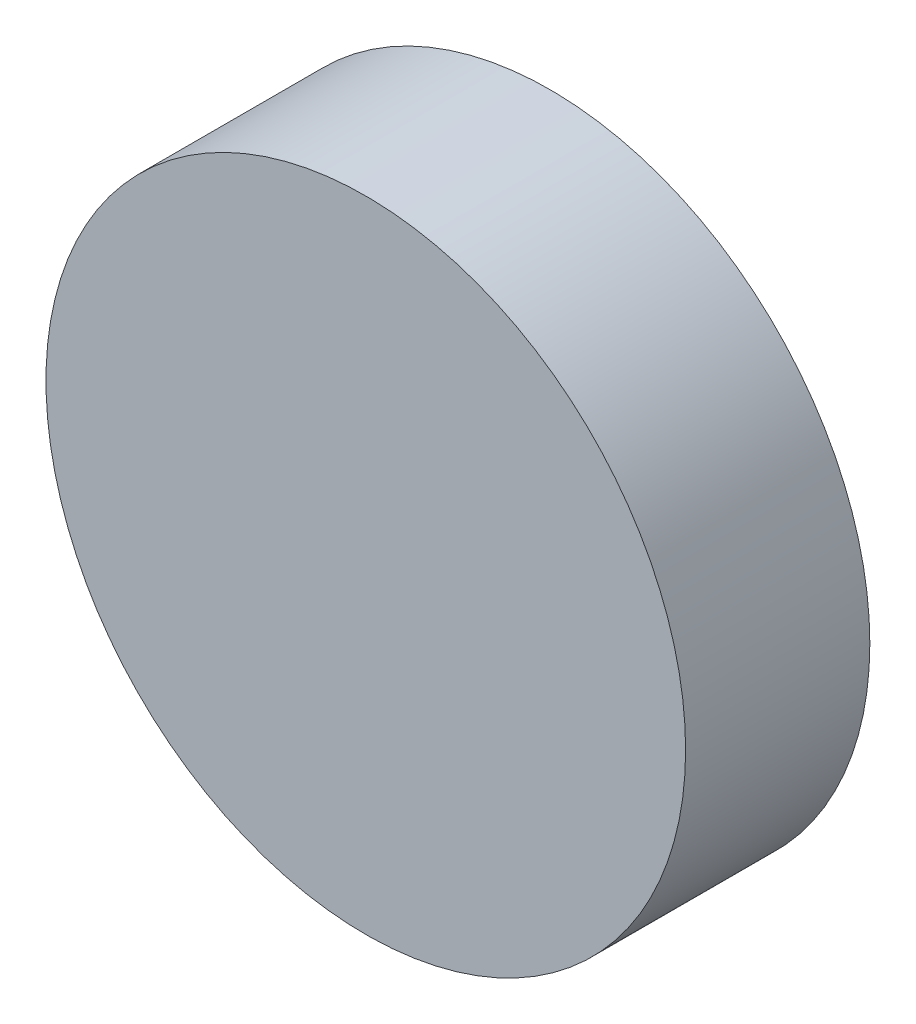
from build123d import *

# Parameters (mm, degrees)
SKETCH1_R           = 17.360491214
BOSS_EXTRUDE1_DEPTH = 10


with BuildPart() as part:
    # Sketch1 → Boss-Extrude1 (new body)
    with BuildSketch(Plane.XY):
        Circle(SKETCH1_R)
    extrude(amount=BOSS_EXTRUDE1_DEPTH)


solid = part.part
